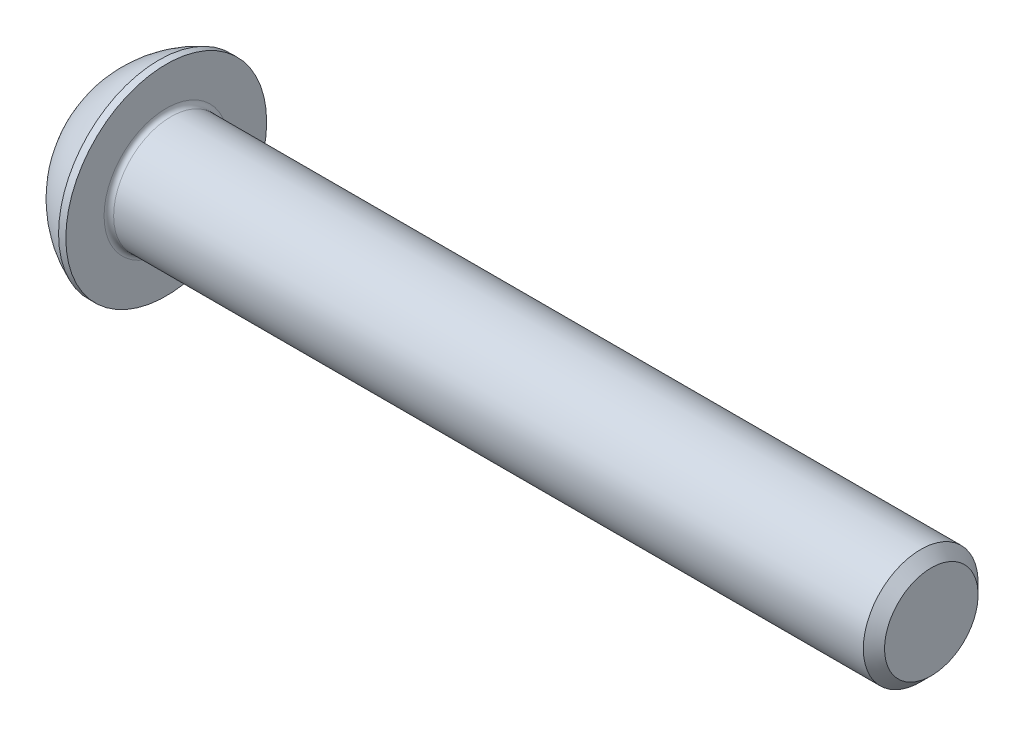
from build123d import *

# Parameters (mm, degrees)
FILLET1_R   = 0.25
HEX_2_DEPTH = 2.08


with BuildPart() as part:
    # BodySke → BaseBody (revolve)
    with BuildSketch(Plane.XY, mode=Mode.PRIVATE) as basebody_sk:
        with BuildLine():
            Line((43.3, 0), (43.3, 2.4455))
            Line((43.3, 2.4455), (42.7455, 3))
            Line((42.7455, 3), (3.3, 3))
            Line((3.3, 3), (3.3, 5.25))
            Line((3.3, 5.25), (2.92, 5.25))
            ThreePointArc((2.92, 5.25), (1.224500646, 4.199464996), (0, 2.625))
            Line((0, 2.625), (0, 0))
            Line((0, 0), (43.3, 0))
        make_face()
    revolve(basebody_sk.sketch.rotate(Axis((0, 0, 0), (1, 0, 0)), 90), axis=Axis((0, 0, 0), (1, 0, 0)))

    # Fillet1
    fillet1_edges = [part.edges().sort_by_distance(p)[0] for p in [
        (3.3, 0, -3),
    ]]
    fillet(fillet1_edges, radius=FILLET1_R)

    # Sketch2 → PreBroach (revolve, cut)
    with BuildSketch(Plane.XY, mode=Mode.PRIVATE) as prebroach_sk:
        Polygon((0, 2), (2.08, 2), (3.234700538, 0), (0, 0), align=None)
    revolve(prebroach_sk.sketch.rotate(Axis((0, 0, 0), (1, 0, 0)), 90), axis=Axis((0, 0, 0), (1, 0, 0)), mode=Mode.SUBTRACT)

    # Sketch3 → Hex 2 (cut)
    with BuildSketch(Plane(origin=(0, 0, 0), x_dir=(0, 0, -1), z_dir=(1, 0, 0))):
        Polygon((-2, -1.154700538), (-2, 1.154700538), (0, 2.309401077), (2, 1.154700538), (2, -1.154700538), (0, -2.309401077), align=None)
    extrude(amount=HEX_2_DEPTH, mode=Mode.SUBTRACT)


solid = part.part
